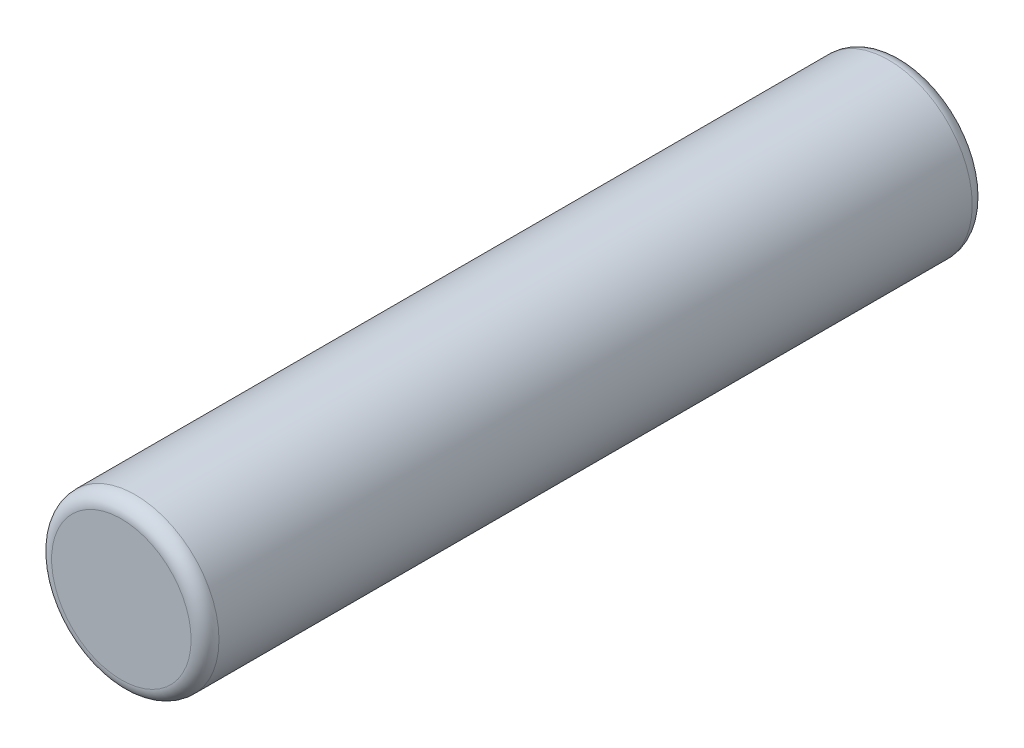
from build123d import *

# Parameters (mm, degrees)
SKETCH_1_R      = 1.5
EXTRUDE_1_DEPTH = 7
FILLET_1_R      = 0.25


with BuildPart() as part:
    # Sketch 1 → Extrude 1 (new, symmetric)
    with BuildSketch(Plane.XY):
        Circle(SKETCH_1_R)
    extrude(amount=EXTRUDE_1_DEPTH, both=True)

    # Fillet 1
    fillet_1_edges = [part.edges().sort_by_distance(p)[0] for p in [
        (-1.5, 0, -7),
        (-1.5, 0, 7),
    ]]
    fillet(fillet_1_edges, radius=FILLET_1_R)


solid = part.part
